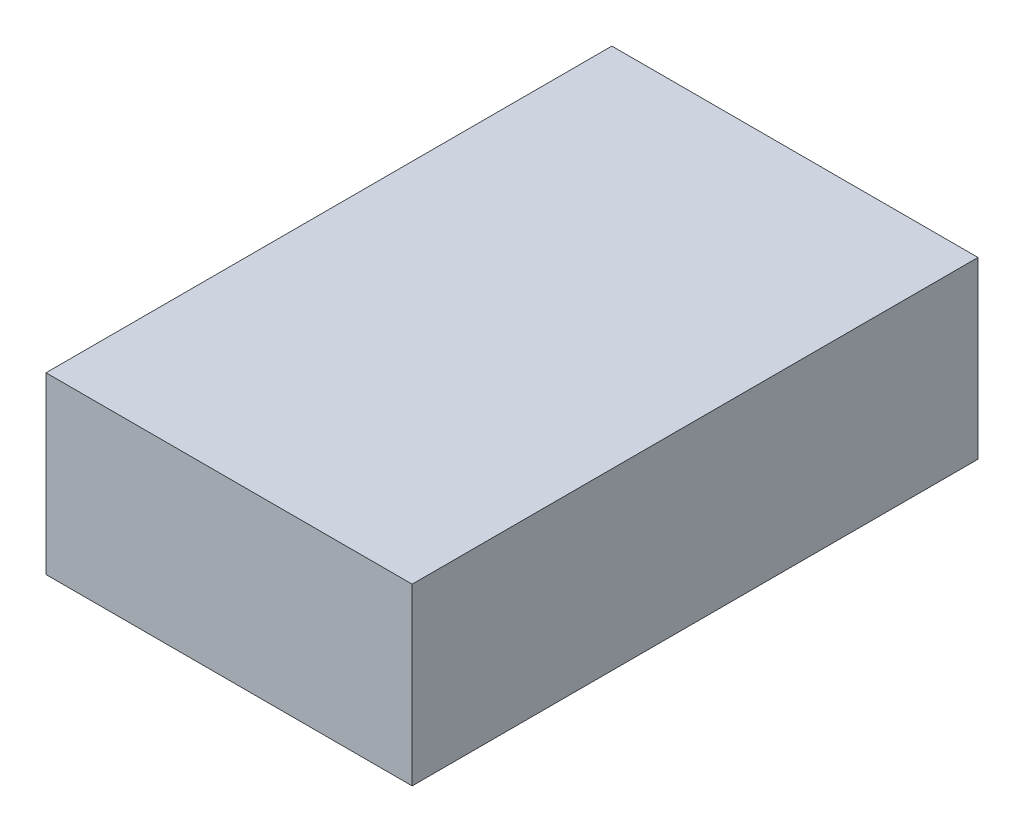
from build123d import *

# Parameters (mm, degrees)
SKETCH_1_W      = 44
SKETCH_1_H      = 68
EXTRUDE_1_DEPTH = 21


with BuildPart() as part:
    # Sketch 1 → Extrude 1 (new body)
    with BuildSketch(Plane(origin=(0, 0, 0), x_dir=(1, 0, 0), z_dir=(0, 1, 0))):
        with Locations((22, 34)):
            Rectangle(SKETCH_1_W, SKETCH_1_H)
    extrude(amount=EXTRUDE_1_DEPTH)


solid = part.part
